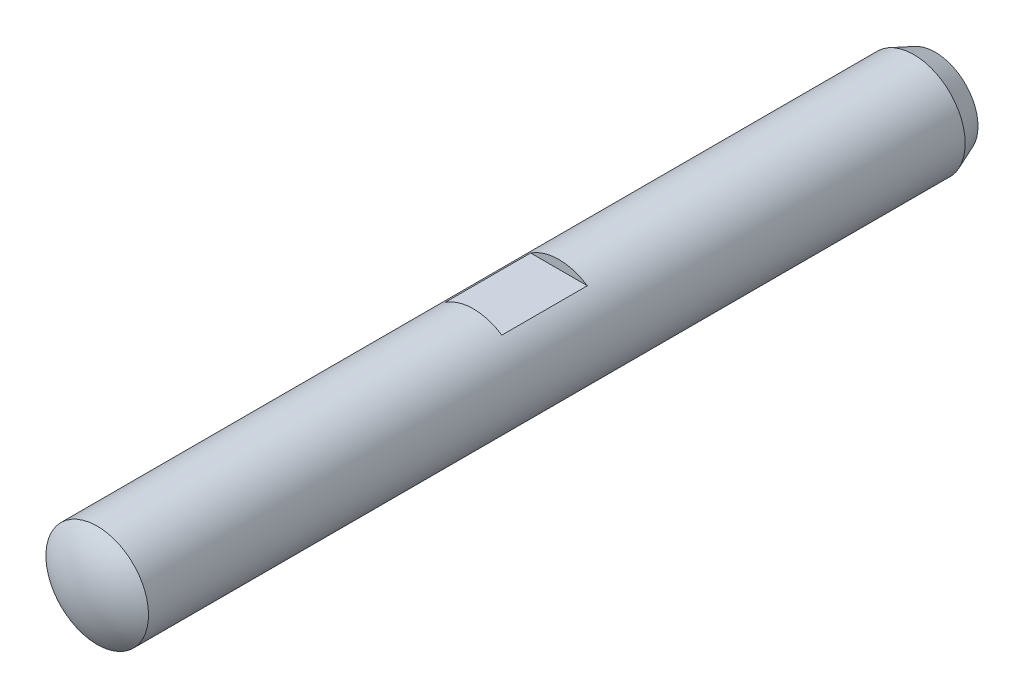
ISO-10303-21;
HEADER;
FILE_DESCRIPTION(('STEP AP214'),'2;1');
FILE_NAME('part.step','',(''),(''),'','','');
FILE_SCHEMA(('AUTOMOTIVE_DESIGN { 1 0 10303 214 1 1 1 1 }'));
ENDSEC;
DATA;
#1=APPLICATION_CONTEXT('core data for automotive mechanical design processes');
#2=APPLICATION_PROTOCOL_DEFINITION('international standard','automotive_design',2000,#1);
#3=PRODUCT_CONTEXT('',#1,'mechanical');
#4=PRODUCT('Part','Part','',(#3));
#5=PRODUCT_RELATED_PRODUCT_CATEGORY('part','',(#4));
#6=PRODUCT_DEFINITION_FORMATION('','',#4);
#7=PRODUCT_DEFINITION_CONTEXT('part definition',#1,'design');
#8=PRODUCT_DEFINITION('design','',#6,#7);
#9=PRODUCT_DEFINITION_SHAPE('','',#8);
#10=(LENGTH_UNIT() NAMED_UNIT(*) SI_UNIT(.MILLI.,.METRE.));
#11=(NAMED_UNIT(*) PLANE_ANGLE_UNIT() SI_UNIT($,.RADIAN.));
#12=(NAMED_UNIT(*) SI_UNIT($,.STERADIAN.) SOLID_ANGLE_UNIT());
#13=UNCERTAINTY_MEASURE_WITH_UNIT(LENGTH_MEASURE(1.E-05),#10,'distance_accuracy_value','');
#14=(GEOMETRIC_REPRESENTATION_CONTEXT(3) GLOBAL_UNCERTAINTY_ASSIGNED_CONTEXT((#13)) GLOBAL_UNIT_ASSIGNED_CONTEXT((#10,
#11,#12)) REPRESENTATION_CONTEXT('',''));
#15=CARTESIAN_POINT('',(0.,0.,0.));
#16=DIRECTION('',(0.,0.,1.));
#17=DIRECTION('',(1.,0.,0.));
#18=AXIS2_PLACEMENT_3D('',#15,#16,#17);
#19=CARTESIAN_POINT('',(0.,0.,49.));
#20=DIRECTION('',(0.,0.,-1.));
#21=DIRECTION('',(-0.999999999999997,0.,0.));
#22=AXIS2_PLACEMENT_3D('',#19,#20,#21);
#23=CYLINDRICAL_SURFACE('',#22,3.);
#24=CARTESIAN_POINT('',(0.,0.,49.));
#25=DIRECTION('',(0.,0.,1.));
#26=DIRECTION('',(0.999999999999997,0.,0.));
#27=AXIS2_PLACEMENT_3D('',#24,#25,#26);
#28=CIRCLE('',#27,3.);
#29=CARTESIAN_POINT('',(2.99999999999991,0.,49.));
#30=VERTEX_POINT('',#29);
#31=EDGE_CURVE('E84',#30,#30,#28,.T.);
#32=ORIENTED_EDGE('',*,*,#31,.F.);
#33=EDGE_LOOP('',(#32));
#34=FACE_BOUND('',#33,.T.);
#35=CARTESIAN_POINT('',(0.,0.,1.25));
#36=DIRECTION('',(0.,0.,1.));
#37=DIRECTION('',(0.999999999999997,0.,0.));
#38=AXIS2_PLACEMENT_3D('',#35,#36,#37);
#39=CIRCLE('',#38,3.);
#40=CARTESIAN_POINT('',(2.99999999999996,0.,1.25));
#41=VERTEX_POINT('',#40);
#42=EDGE_CURVE('E81',#41,#41,#39,.T.);
#43=ORIENTED_EDGE('',*,*,#42,.T.);
#44=EDGE_LOOP('',(#43));
#45=FACE_BOUND('',#44,.T.);
#46=CARTESIAN_POINT('',(0.,0.,27.));
#47=DIRECTION('',(0.,0.,-1.));
#48=DIRECTION('',(-0.999999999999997,0.,0.));
#49=AXIS2_PLACEMENT_3D('',#46,#47,#48);
#50=CIRCLE('',#49,3.);
#51=CARTESIAN_POINT('',(-1.65831239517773,2.5,27.));
#52=VERTEX_POINT('',#51);
#53=CARTESIAN_POINT('',(1.65831239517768,2.50000000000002,27.));
#54=VERTEX_POINT('',#53);
#55=EDGE_CURVE('E11',#52,#54,#50,.T.);
#56=ORIENTED_EDGE('',*,*,#55,.F.);
#57=DIRECTION('',(0.,0.,-1.));
#58=VECTOR('',#57,1.);
#59=CARTESIAN_POINT('',(-1.65831239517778,2.5,49.));
#60=LINE('',#59,#58);
#61=CARTESIAN_POINT('',(-1.65831239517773,2.5,22.));
#62=VERTEX_POINT('',#61);
#63=EDGE_CURVE('E70',#62,#52,#60,.F.);
#64=ORIENTED_EDGE('',*,*,#63,.F.);
#65=CARTESIAN_POINT('',(0.,0.,22.));
#66=DIRECTION('',(0.,0.,-1.));
#67=DIRECTION('',(-0.999999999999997,0.,0.));
#68=AXIS2_PLACEMENT_3D('',#65,#66,#67);
#69=CIRCLE('',#68,3.);
#70=CARTESIAN_POINT('',(1.65831239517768,2.5,22.));
#71=VERTEX_POINT('',#70);
#72=EDGE_CURVE('E65',#62,#71,#69,.T.);
#73=ORIENTED_EDGE('',*,*,#72,.T.);
#74=DIRECTION('',(0.,0.,-1.));
#75=VECTOR('',#74,1.);
#76=CARTESIAN_POINT('',(1.65831239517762,2.5,49.));
#77=LINE('',#76,#75);
#78=EDGE_CURVE('E47',#54,#71,#77,.T.);
#79=ORIENTED_EDGE('',*,*,#78,.F.);
#80=EDGE_LOOP('',(#56,#64,#73,#79));
#81=FACE_BOUND('',#80,.T.);
#82=ADVANCED_FACE('F39',(#34,#45,#81),#23,.T.);
#83=CARTESIAN_POINT('',(0.,0.,45.));
#84=DIRECTION('',(0.,0.,1.));
#85=DIRECTION('',(0.999999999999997,0.,0.));
#86=AXIS2_PLACEMENT_3D('',#83,#84,#85);
#87=SPHERICAL_SURFACE('',#86,5.);
#88=ORIENTED_EDGE('',*,*,#31,.T.);
#89=EDGE_LOOP('',(#88));
#90=FACE_BOUND('',#89,.T.);
#91=ADVANCED_FACE('F98',(#90),#87,.T.);
#92=CARTESIAN_POINT('',(0.,0.,3.79166666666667));
#93=DIRECTION('',(0.,0.,1.));
#94=DIRECTION('',(0.999999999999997,0.,0.));
#95=AXIS2_PLACEMENT_3D('',#92,#93,#94);
#96=SPHERICAL_SURFACE('',#95,4.54166666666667);
#97=CARTESIAN_POINT('',(0.,0.,0.));
#98=DIRECTION('',(0.,0.,1.));
#99=DIRECTION('',(0.999999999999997,0.,0.));
#100=AXIS2_PLACEMENT_3D('',#97,#98,#99);
#101=CIRCLE('',#100,2.5);
#102=CARTESIAN_POINT('',(2.49999999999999,0.,0.));
#103=VERTEX_POINT('',#102);
#104=EDGE_CURVE('E71',#103,#103,#101,.F.);
#105=ORIENTED_EDGE('',*,*,#104,.T.);
#106=EDGE_LOOP('',(#105));
#107=FACE_BOUND('',#106,.T.);
#108=ADVANCED_FACE('F41',(#107),#96,.T.);
#109=CARTESIAN_POINT('',(0.,0.,1.25));
#110=DIRECTION('',(0.,0.,1.));
#111=DIRECTION('',(0.999999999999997,0.,0.));
#112=AXIS2_PLACEMENT_3D('',#109,#110,#111);
#113=CONICAL_SURFACE('',#112,3.,0.380506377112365);
#114=ORIENTED_EDGE('',*,*,#104,.F.);
#115=EDGE_LOOP('',(#114));
#116=FACE_BOUND('',#115,.T.);
#117=ORIENTED_EDGE('',*,*,#42,.F.);
#118=EDGE_LOOP('',(#117));
#119=FACE_BOUND('',#118,.T.);
#120=ADVANCED_FACE('F95',(#116,#119),#113,.T.);
#121=CARTESIAN_POINT('',(-3.50000000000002,2.5,27.));
#122=DIRECTION('',(0.,1.,0.));
#123=DIRECTION('',(-0.999999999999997,0.,0.));
#124=AXIS2_PLACEMENT_3D('',#121,#122,#123);
#125=PLANE('',#124);
#126=ORIENTED_EDGE('',*,*,#78,.T.);
#127=DIRECTION('',(0.999999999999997,0.,0.));
#128=VECTOR('',#127,1.);
#129=CARTESIAN_POINT('',(-3.50000000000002,2.5,22.));
#130=LINE('',#129,#128);
#131=EDGE_CURVE('E53',#62,#71,#130,.T.);
#132=ORIENTED_EDGE('',*,*,#131,.F.);
#133=ORIENTED_EDGE('',*,*,#63,.T.);
#134=DIRECTION('',(0.999999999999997,0.,0.));
#135=VECTOR('',#134,1.);
#136=CARTESIAN_POINT('',(-3.50000000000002,2.5,27.));
#137=LINE('',#136,#135);
#138=EDGE_CURVE('E75',#52,#54,#137,.T.);
#139=ORIENTED_EDGE('',*,*,#138,.T.);
#140=EDGE_LOOP('',(#126,#132,#133,#139));
#141=FACE_BOUND('',#140,.T.);
#142=ADVANCED_FACE('F74',(#141),#125,.T.);
#143=CARTESIAN_POINT('',(-3.50000000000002,4.5,27.));
#144=DIRECTION('',(0.,0.,-1.));
#145=DIRECTION('',(-0.999999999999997,0.,0.));
#146=AXIS2_PLACEMENT_3D('',#143,#144,#145);
#147=PLANE('',#146);
#148=ORIENTED_EDGE('',*,*,#55,.T.);
#149=ORIENTED_EDGE('',*,*,#138,.F.);
#150=EDGE_LOOP('',(#148,#149));
#151=FACE_BOUND('',#150,.T.);
#152=ADVANCED_FACE('F87',(#151),#147,.T.);
#153=CARTESIAN_POINT('',(-3.49999999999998,4.5,22.));
#154=DIRECTION('',(0.,0.,-1.));
#155=DIRECTION('',(-0.999999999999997,0.,0.));
#156=AXIS2_PLACEMENT_3D('',#153,#154,#155);
#157=PLANE('',#156);
#158=ORIENTED_EDGE('',*,*,#131,.T.);
#159=ORIENTED_EDGE('',*,*,#72,.F.);
#160=EDGE_LOOP('',(#158,#159));
#161=FACE_BOUND('',#160,.T.);
#162=ADVANCED_FACE('F66',(#161),#157,.F.);
#163=CLOSED_SHELL('',(#82,#91,#108,#120,#142,#152,#162));
#164=MANIFOLD_SOLID_BREP('B2',#163);
#165=ADVANCED_BREP_SHAPE_REPRESENTATION('',(#18,#164),#14);
#166=SHAPE_DEFINITION_REPRESENTATION(#9,#165);
ENDSEC;
END-ISO-10303-21;
